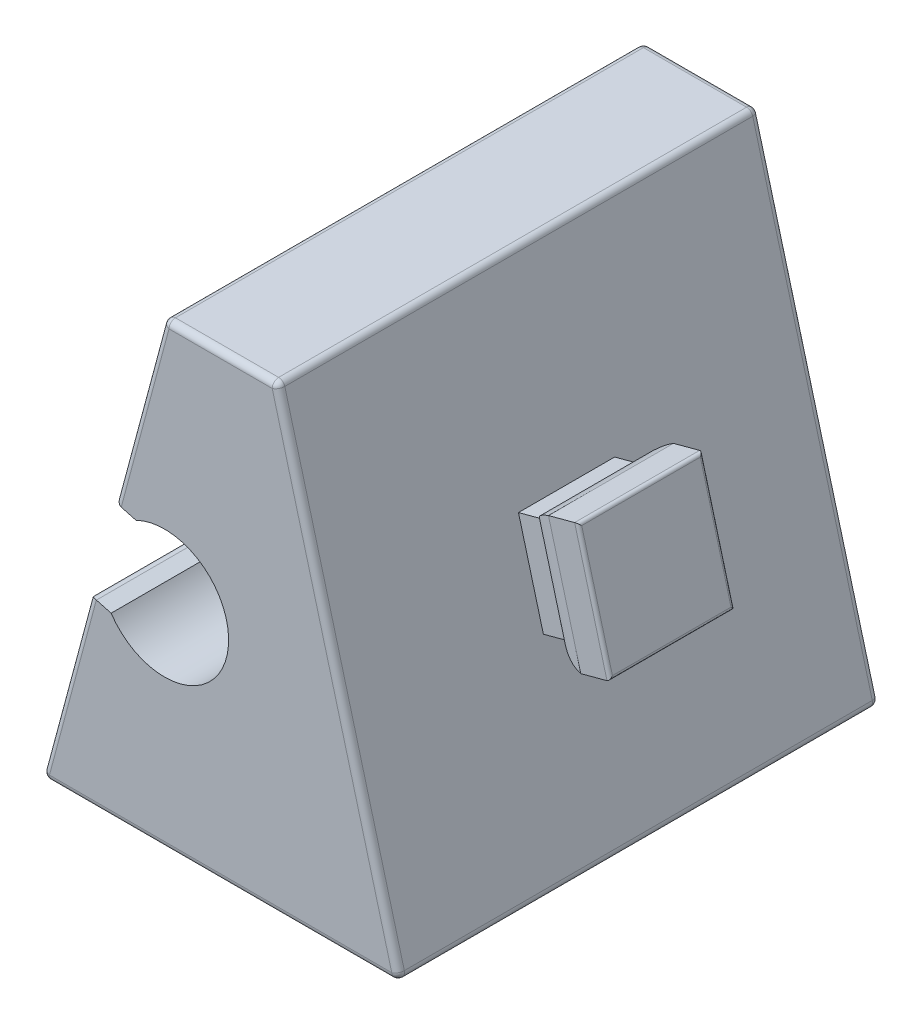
ISO-10303-21;
HEADER;
FILE_DESCRIPTION(('STEP AP214'),'2;1');
FILE_NAME('part.step','',(''),(''),'','','');
FILE_SCHEMA(('AUTOMOTIVE_DESIGN { 1 0 10303 214 1 1 1 1 }'));
ENDSEC;
DATA;
#1=APPLICATION_CONTEXT('core data for automotive mechanical design processes');
#2=APPLICATION_PROTOCOL_DEFINITION('international standard','automotive_design',2000,#1);
#3=PRODUCT_CONTEXT('',#1,'mechanical');
#4=PRODUCT('Part','Part','',(#3));
#5=PRODUCT_RELATED_PRODUCT_CATEGORY('part','',(#4));
#6=PRODUCT_DEFINITION_FORMATION('','',#4);
#7=PRODUCT_DEFINITION_CONTEXT('part definition',#1,'design');
#8=PRODUCT_DEFINITION('design','',#6,#7);
#9=PRODUCT_DEFINITION_SHAPE('','',#8);
#10=(LENGTH_UNIT() NAMED_UNIT(*) SI_UNIT(.MILLI.,.METRE.));
#11=(NAMED_UNIT(*) PLANE_ANGLE_UNIT() SI_UNIT($,.RADIAN.));
#12=(NAMED_UNIT(*) SI_UNIT($,.STERADIAN.) SOLID_ANGLE_UNIT());
#13=UNCERTAINTY_MEASURE_WITH_UNIT(LENGTH_MEASURE(1.E-05),#10,'distance_accuracy_value','');
#14=(GEOMETRIC_REPRESENTATION_CONTEXT(3) GLOBAL_UNCERTAINTY_ASSIGNED_CONTEXT((#13)) GLOBAL_UNIT_ASSIGNED_CONTEXT((#10,
#11,#12)) REPRESENTATION_CONTEXT('',''));
#15=CARTESIAN_POINT('',(0.,0.,0.));
#16=DIRECTION('',(0.,0.,1.));
#17=DIRECTION('',(1.,0.,0.));
#18=AXIS2_PLACEMENT_3D('',#15,#16,#17);
#19=CARTESIAN_POINT('',(5.19043169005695,11.1877880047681,5.55));
#20=DIRECTION('',(0.965925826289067,0.258819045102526,0.));
#21=DIRECTION('',(-0.258819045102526,0.965925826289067,0.));
#22=AXIS2_PLACEMENT_3D('',#19,#20,#21);
#23=PLANE('',#22);
#24=DIRECTION('',(0.258819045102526,-0.965925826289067,0.));
#25=VECTOR('',#24,1.);
#26=CARTESIAN_POINT('',(5.19043169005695,11.1877880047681,9.35));
#27=LINE('',#26,#25);
#28=CARTESIAN_POINT('',(5.61748311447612,9.59401039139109,9.35));
#29=VERTEX_POINT('',#28);
#30=CARTESIAN_POINT('',(6.57511358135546,6.02008483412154,9.35));
#31=VERTEX_POINT('',#30);
#32=EDGE_CURVE('E362',#29,#31,#27,.T.);
#33=ORIENTED_EDGE('',*,*,#32,.T.);
#34=DIRECTION('',(0.,0.,-1.));
#35=VECTOR('',#34,1.);
#36=CARTESIAN_POINT('',(6.57511358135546,6.02008483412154,5.55));
#37=LINE('',#36,#35);
#38=CARTESIAN_POINT('',(6.57511358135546,6.02008483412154,5.65));
#39=VERTEX_POINT('',#38);
#40=EDGE_CURVE('E448',#31,#39,#37,.T.);
#41=ORIENTED_EDGE('',*,*,#40,.T.);
#42=DIRECTION('',(0.258819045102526,-0.965925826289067,0.));
#43=VECTOR('',#42,1.);
#44=CARTESIAN_POINT('',(5.19043169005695,11.1877880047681,5.65));
#45=LINE('',#44,#43);
#46=CARTESIAN_POINT('',(5.61748311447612,9.59401039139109,5.65));
#47=VERTEX_POINT('',#46);
#48=EDGE_CURVE('E446',#39,#47,#45,.F.);
#49=ORIENTED_EDGE('',*,*,#48,.T.);
#50=DIRECTION('',(0.,0.,-1.));
#51=VECTOR('',#50,1.);
#52=CARTESIAN_POINT('',(5.61748311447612,9.59401039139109,5.55));
#53=LINE('',#52,#51);
#54=EDGE_CURVE('E444',#47,#29,#53,.F.);
#55=ORIENTED_EDGE('',*,*,#54,.T.);
#56=EDGE_LOOP('',(#33,#41,#49,#55));
#57=FACE_BOUND('',#56,.T.);
#58=ADVANCED_FACE('F34',(#57),#23,.T.);
#59=CARTESIAN_POINT('',(5.19043169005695,11.1877880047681,5.55));
#60=DIRECTION('',(0.,0.,-1.));
#61=DIRECTION('',(-1.,0.,0.));
#62=AXIS2_PLACEMENT_3D('',#59,#60,#61);
#63=PLANE('',#62);
#64=DIRECTION('',(0.965925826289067,0.258819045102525,0.));
#65=VECTOR('',#64,1.);
#66=CARTESIAN_POINT('',(5.59160120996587,9.69060297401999,5.55));
#67=LINE('',#66,#65);
#68=CARTESIAN_POINT('',(4.67937146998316,9.44617175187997,5.55));
#69=VERTEX_POINT('',#68);
#70=CARTESIAN_POINT('',(5.49500862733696,9.66472106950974,5.55));
#71=VERTEX_POINT('',#70);
#72=EDGE_CURVE('E479',#69,#71,#67,.T.);
#73=ORIENTED_EDGE('',*,*,#72,.T.);
#74=DIRECTION('',(0.258819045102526,-0.965925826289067,0.));
#75=VECTOR('',#74,1.);
#76=CARTESIAN_POINT('',(5.09383910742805,11.1619061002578,5.55));
#77=LINE('',#76,#75);
#78=CARTESIAN_POINT('',(6.50440290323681,5.89761034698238,5.55));
#79=VERTEX_POINT('',#78);
#80=EDGE_CURVE('E454',#71,#79,#77,.T.);
#81=ORIENTED_EDGE('',*,*,#80,.T.);
#82=DIRECTION('',(-0.965925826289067,-0.258819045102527,0.));
#83=VECTOR('',#82,1.);
#84=CARTESIAN_POINT('',(6.60099548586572,5.92349225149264,5.55));
#85=LINE('',#84,#83);
#86=CARTESIAN_POINT('',(5.68876574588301,5.67906102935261,5.55));
#87=VERTEX_POINT('',#86);
#88=EDGE_CURVE('E244',#79,#87,#85,.T.);
#89=ORIENTED_EDGE('',*,*,#88,.T.);
#90=DIRECTION('',(0.258819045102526,-0.965925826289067,0.));
#91=VECTOR('',#90,1.);
#92=CARTESIAN_POINT('',(4.27820195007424,10.943356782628,5.55));
#93=LINE('',#92,#91);
#94=EDGE_CURVE('E243',#69,#87,#93,.T.);
#95=ORIENTED_EDGE('',*,*,#94,.F.);
#96=EDGE_LOOP('',(#73,#81,#89,#95));
#97=FACE_BOUND('',#96,.T.);
#98=ADVANCED_FACE('F478',(#97),#63,.T.);
#99=CARTESIAN_POINT('',(4.70746877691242,11.0583784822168,7.5));
#100=DIRECTION('',(0.258819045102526,-0.965925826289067,0.));
#101=DIRECTION('',(0.965925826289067,0.258819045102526,0.));
#102=AXIS2_PLACEMENT_3D('',#99,#100,#101);
#103=CYLINDRICAL_SURFACE('',#102,2.);
#104=ORIENTED_EDGE('',*,*,#94,.T.);
#105=CARTESIAN_POINT('',(5.61333543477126,7.67763809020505,7.5));
#106=DIRECTION('',(0.183012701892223,-0.683012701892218,0.707106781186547));
#107=DIRECTION('',(0.183012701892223,-0.683012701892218,-0.707106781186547));
#108=AXIS2_PLACEMENT_3D('',#105,#106,#107);
#109=ELLIPSE('',#108,2.82842712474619,2.);
#110=CARTESIAN_POINT('',(4.72376424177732,5.8863639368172,6.));
#111=VERTEX_POINT('',#110);
#112=EDGE_CURVE('E223',#87,#111,#109,.F.);
#113=ORIENTED_EDGE('',*,*,#112,.T.);
#114=DIRECTION('',(0.258819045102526,-0.965925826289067,0.));
#115=VECTOR('',#114,1.);
#116=CARTESIAN_POINT('',(3.42966901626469,10.7159930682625,6.));
#117=LINE('',#116,#115);
#118=CARTESIAN_POINT('',(3.94730710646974,8.78414141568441,6.));
#119=VERTEX_POINT('',#118);
#120=EDGE_CURVE('E240',#119,#111,#117,.T.);
#121=ORIENTED_EDGE('',*,*,#120,.F.);
#122=CARTESIAN_POINT('',(5.61333543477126,7.67763809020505,7.5));
#123=DIRECTION('',(0.183012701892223,-0.683012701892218,-0.707106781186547));
#124=DIRECTION('',(0.183012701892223,-0.683012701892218,0.707106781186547));
#125=AXIS2_PLACEMENT_3D('',#122,#123,#124);
#126=ELLIPSE('',#125,2.82842712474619,2.);
#127=EDGE_CURVE('E981',#119,#69,#126,.T.);
#128=ORIENTED_EDGE('',*,*,#127,.T.);
#129=EDGE_LOOP('',(#104,#113,#121,#128));
#130=FACE_BOUND('',#129,.T.);
#131=ADVANCED_FACE('F238',(#130),#103,.T.);
#132=CARTESIAN_POINT('',(4.70746877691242,11.0583784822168,7.5));
#133=DIRECTION('',(0.258819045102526,-0.965925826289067,0.));
#134=DIRECTION('',(0.965925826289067,0.258819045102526,0.));
#135=AXIS2_PLACEMENT_3D('',#132,#133,#134);
#136=CYLINDRICAL_SURFACE('',#135,2.);
#137=DIRECTION('',(0.258819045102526,-0.965925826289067,0.));
#138=VECTOR('',#137,1.);
#139=CARTESIAN_POINT('',(3.42966901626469,10.7159930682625,9.));
#140=LINE('',#139,#138);
#141=CARTESIAN_POINT('',(3.94730710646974,8.78414141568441,9.));
#142=VERTEX_POINT('',#141);
#143=CARTESIAN_POINT('',(4.72376424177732,5.8863639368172,9.));
#144=VERTEX_POINT('',#143);
#145=EDGE_CURVE('E253',#142,#144,#140,.T.);
#146=ORIENTED_EDGE('',*,*,#145,.T.);
#147=CARTESIAN_POINT('',(5.61333543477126,7.67763809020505,7.5));
#148=DIRECTION('',(0.183012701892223,-0.683012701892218,-0.707106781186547));
#149=DIRECTION('',(0.183012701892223,-0.683012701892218,0.707106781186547));
#150=AXIS2_PLACEMENT_3D('',#147,#148,#149);
#151=ELLIPSE('',#150,2.82842712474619,2.);
#152=CARTESIAN_POINT('',(5.68876574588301,5.67906102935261,9.45));
#153=VERTEX_POINT('',#152);
#154=EDGE_CURVE('E226',#144,#153,#151,.F.);
#155=ORIENTED_EDGE('',*,*,#154,.T.);
#156=DIRECTION('',(0.258819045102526,-0.965925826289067,0.));
#157=VECTOR('',#156,1.);
#158=CARTESIAN_POINT('',(4.27820195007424,10.943356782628,9.45));
#159=LINE('',#158,#157);
#160=CARTESIAN_POINT('',(4.67937146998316,9.44617175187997,9.45));
#161=VERTEX_POINT('',#160);
#162=EDGE_CURVE('E979',#161,#153,#159,.T.);
#163=ORIENTED_EDGE('',*,*,#162,.F.);
#164=CARTESIAN_POINT('',(5.61333543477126,7.67763809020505,7.5));
#165=DIRECTION('',(0.183012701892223,-0.683012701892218,0.707106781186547));
#166=DIRECTION('',(0.183012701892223,-0.683012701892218,-0.707106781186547));
#167=AXIS2_PLACEMENT_3D('',#164,#165,#166);
#168=ELLIPSE('',#167,2.82842712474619,2.);
#169=EDGE_CURVE('E977',#161,#142,#168,.T.);
#170=ORIENTED_EDGE('',*,*,#169,.T.);
#171=EDGE_LOOP('',(#146,#155,#163,#170));
#172=FACE_BOUND('',#171,.T.);
#173=ADVANCED_FACE('F842',(#172),#136,.T.);
#174=CARTESIAN_POINT('',(5.19043169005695,11.1877880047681,9.45));
#175=DIRECTION('',(0.,0.,1.));
#176=DIRECTION('',(1.,0.,0.));
#177=AXIS2_PLACEMENT_3D('',#174,#175,#176);
#178=PLANE('',#177);
#179=DIRECTION('',(0.965925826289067,0.258819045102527,0.));
#180=VECTOR('',#179,1.);
#181=CARTESIAN_POINT('',(6.60099548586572,5.92349225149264,9.45));
#182=LINE('',#181,#180);
#183=CARTESIAN_POINT('',(6.50440290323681,5.89761034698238,9.45));
#184=VERTEX_POINT('',#183);
#185=EDGE_CURVE('E290',#153,#184,#182,.T.);
#186=ORIENTED_EDGE('',*,*,#185,.T.);
#187=DIRECTION('',(0.258819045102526,-0.965925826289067,0.));
#188=VECTOR('',#187,1.);
#189=CARTESIAN_POINT('',(5.09383910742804,11.1619061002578,9.45));
#190=LINE('',#189,#188);
#191=CARTESIAN_POINT('',(5.49500862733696,9.66472106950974,9.45));
#192=VERTEX_POINT('',#191);
#193=EDGE_CURVE('E11',#184,#192,#190,.F.);
#194=ORIENTED_EDGE('',*,*,#193,.T.);
#195=DIRECTION('',(-0.965925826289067,-0.258819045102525,0.));
#196=VECTOR('',#195,1.);
#197=CARTESIAN_POINT('',(5.59160120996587,9.69060297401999,9.45));
#198=LINE('',#197,#196);
#199=EDGE_CURVE('E231',#192,#161,#198,.T.);
#200=ORIENTED_EDGE('',*,*,#199,.T.);
#201=ORIENTED_EDGE('',*,*,#162,.T.);
#202=EDGE_LOOP('',(#186,#194,#200,#201));
#203=FACE_BOUND('',#202,.T.);
#204=ADVANCED_FACE('F497',(#203),#178,.T.);
#205=CARTESIAN_POINT('',(5.6,0.,15.));
#206=DIRECTION('',(-0.965925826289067,-0.258819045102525,0.));
#207=DIRECTION('',(0.258819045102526,-0.965925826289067,0.));
#208=AXIS2_PLACEMENT_3D('',#205,#206,#207);
#209=PLANE('',#208);
#210=DIRECTION('',(-0.258819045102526,0.965925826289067,0.));
#211=VECTOR('',#210,1.);
#212=CARTESIAN_POINT('',(5.6,0.,14.8));
#213=LINE('',#212,#211);
#214=CARTESIAN_POINT('',(1.80268733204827,14.1717638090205,14.8));
#215=VERTEX_POINT('',#214);
#216=CARTESIAN_POINT('',(5.53254009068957,0.251763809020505,14.8));
#217=VERTEX_POINT('',#216);
#218=EDGE_CURVE('E338',#215,#217,#213,.F.);
#219=ORIENTED_EDGE('',*,*,#218,.T.);
#220=DIRECTION('',(0.,0.,-1.));
#221=VECTOR('',#220,1.);
#222=CARTESIAN_POINT('',(5.53254009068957,0.251763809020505,15.));
#223=LINE('',#222,#221);
#224=CARTESIAN_POINT('',(5.53254009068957,0.251763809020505,0.200000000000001));
#225=VERTEX_POINT('',#224);
#226=EDGE_CURVE('E340',#217,#225,#223,.T.);
#227=ORIENTED_EDGE('',*,*,#226,.T.);
#228=DIRECTION('',(-0.258819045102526,0.965925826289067,0.));
#229=VECTOR('',#228,1.);
#230=CARTESIAN_POINT('',(5.6,0.,0.200000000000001));
#231=LINE('',#230,#229);
#232=CARTESIAN_POINT('',(1.80268733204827,14.1717638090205,0.200000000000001));
#233=VERTEX_POINT('',#232);
#234=EDGE_CURVE('E336',#225,#233,#231,.T.);
#235=ORIENTED_EDGE('',*,*,#234,.T.);
#236=DIRECTION('',(0.,0.,-1.));
#237=VECTOR('',#236,1.);
#238=CARTESIAN_POINT('',(1.80268733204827,14.1717638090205,15.));
#239=LINE('',#238,#237);
#240=EDGE_CURVE('E334',#233,#215,#239,.F.);
#241=ORIENTED_EDGE('',*,*,#240,.T.);
#242=EDGE_LOOP('',(#219,#227,#235,#241));
#243=FACE_BOUND('',#242,.T.);
#244=DIRECTION('',(-0.258819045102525,0.965925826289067,0.));
#245=VECTOR('',#244,1.);
#246=CARTESIAN_POINT('',(3.29325521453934,8.6088887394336,6.));
#247=LINE('',#246,#245);
#248=CARTESIAN_POINT('',(4.06971234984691,5.7111112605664,6.));
#249=VERTEX_POINT('',#248);
#250=CARTESIAN_POINT('',(3.29325521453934,8.6088887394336,6.));
#251=VERTEX_POINT('',#250);
#252=EDGE_CURVE('E987',#249,#251,#247,.T.);
#253=ORIENTED_EDGE('',*,*,#252,.F.);
#254=DIRECTION('',(0.,0.,-1.));
#255=VECTOR('',#254,1.);
#256=CARTESIAN_POINT('',(4.06971234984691,5.7111112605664,9.));
#257=LINE('',#256,#255);
#258=CARTESIAN_POINT('',(4.06971234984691,5.7111112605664,9.));
#259=VERTEX_POINT('',#258);
#260=EDGE_CURVE('E258',#259,#249,#257,.T.);
#261=ORIENTED_EDGE('',*,*,#260,.F.);
#262=DIRECTION('',(0.258819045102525,-0.965925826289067,0.));
#263=VECTOR('',#262,1.);
#264=CARTESIAN_POINT('',(3.29325521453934,8.6088887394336,9.));
#265=LINE('',#264,#263);
#266=CARTESIAN_POINT('',(3.29325521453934,8.60888873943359,9.));
#267=VERTEX_POINT('',#266);
#268=EDGE_CURVE('E263',#267,#259,#265,.T.);
#269=ORIENTED_EDGE('',*,*,#268,.F.);
#270=DIRECTION('',(0.,0.,1.));
#271=VECTOR('',#270,1.);
#272=CARTESIAN_POINT('',(3.29325521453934,8.6088887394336,9.));
#273=LINE('',#272,#271);
#274=EDGE_CURVE('E989',#251,#267,#273,.T.);
#275=ORIENTED_EDGE('',*,*,#274,.F.);
#276=EDGE_LOOP('',(#253,#261,#269,#275));
#277=FACE_BOUND('',#276,.T.);
#278=ADVANCED_FACE('F533',(#243,#277),#209,.F.);
#279=CARTESIAN_POINT('',(-5.6,0.,15.));
#280=DIRECTION('',(0.965925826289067,-0.258819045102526,0.));
#281=DIRECTION('',(0.258819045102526,0.965925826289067,0.));
#282=AXIS2_PLACEMENT_3D('',#279,#280,#281);
#283=PLANE('',#282);
#284=DIRECTION('',(0.,0.,-1.));
#285=VECTOR('',#284,1.);
#286=CARTESIAN_POINT('',(-1.80268733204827,14.1717638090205,15.));
#287=LINE('',#286,#285);
#288=CARTESIAN_POINT('',(-1.80268733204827,14.1717638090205,14.8));
#289=VERTEX_POINT('',#288);
#290=CARTESIAN_POINT('',(-1.80268733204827,14.1717638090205,0.200000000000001));
#291=VERTEX_POINT('',#290);
#292=EDGE_CURVE('E292',#289,#291,#287,.T.);
#293=ORIENTED_EDGE('',*,*,#292,.T.);
#294=DIRECTION('',(-0.258819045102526,-0.965925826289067,0.));
#295=VECTOR('',#294,1.);
#296=CARTESIAN_POINT('',(-5.6,0.,0.200000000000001));
#297=LINE('',#296,#295);
#298=CARTESIAN_POINT('',(-3.24149140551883,8.80207390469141,0.200000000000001));
#299=VERTEX_POINT('',#298);
#300=EDGE_CURVE('E298',#291,#299,#297,.T.);
#301=ORIENTED_EDGE('',*,*,#300,.T.);
#302=DIRECTION('',(0.,0.,1.));
#303=VECTOR('',#302,1.);
#304=CARTESIAN_POINT('',(-3.24149140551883,8.80207390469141,15.));
#305=LINE('',#304,#303);
#306=CARTESIAN_POINT('',(-3.24149140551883,8.80207390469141,14.8));
#307=VERTEX_POINT('',#306);
#308=EDGE_CURVE('E296',#299,#307,#305,.T.);
#309=ORIENTED_EDGE('',*,*,#308,.T.);
#310=DIRECTION('',(-0.258819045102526,-0.965925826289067,0.));
#311=VECTOR('',#310,1.);
#312=CARTESIAN_POINT('',(-1.76296756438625,14.32,14.8));
#313=LINE('',#312,#311);
#314=EDGE_CURVE('E294',#307,#289,#313,.F.);
#315=ORIENTED_EDGE('',*,*,#314,.T.);
#316=EDGE_LOOP('',(#293,#301,#309,#315));
#317=FACE_BOUND('',#316,.T.);
#318=ADVANCED_FACE('F536',(#317),#283,.F.);
#319=CARTESIAN_POINT('',(-1.76296756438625,14.32,15.));
#320=DIRECTION('',(0.,-1.,0.));
#321=DIRECTION('',(1.,0.,0.));
#322=AXIS2_PLACEMENT_3D('',#319,#320,#321);
#323=PLANE('',#322);
#324=DIRECTION('',(0.,0.,-1.));
#325=VECTOR('',#324,1.);
#326=CARTESIAN_POINT('',(1.60950216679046,14.32,15.));
#327=LINE('',#326,#325);
#328=CARTESIAN_POINT('',(1.60950216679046,14.32,14.8));
#329=VERTEX_POINT('',#328);
#330=CARTESIAN_POINT('',(1.60950216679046,14.32,0.200000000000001));
#331=VERTEX_POINT('',#330);
#332=EDGE_CURVE('E355',#329,#331,#327,.T.);
#333=ORIENTED_EDGE('',*,*,#332,.T.);
#334=DIRECTION('',(-1.,0.,0.));
#335=VECTOR('',#334,1.);
#336=CARTESIAN_POINT('',(-1.76296756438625,14.32,0.200000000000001));
#337=LINE('',#336,#335);
#338=CARTESIAN_POINT('',(-1.60950216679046,14.32,0.200000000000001));
#339=VERTEX_POINT('',#338);
#340=EDGE_CURVE('E359',#331,#339,#337,.T.);
#341=ORIENTED_EDGE('',*,*,#340,.T.);
#342=DIRECTION('',(0.,0.,-1.));
#343=VECTOR('',#342,1.);
#344=CARTESIAN_POINT('',(-1.60950216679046,14.32,15.));
#345=LINE('',#344,#343);
#346=CARTESIAN_POINT('',(-1.60950216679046,14.32,14.8));
#347=VERTEX_POINT('',#346);
#348=EDGE_CURVE('E357',#339,#347,#345,.F.);
#349=ORIENTED_EDGE('',*,*,#348,.T.);
#350=DIRECTION('',(-1.,0.,0.));
#351=VECTOR('',#350,1.);
#352=CARTESIAN_POINT('',(1.76296756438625,14.32,14.8));
#353=LINE('',#352,#351);
#354=EDGE_CURVE('E353',#347,#329,#353,.F.);
#355=ORIENTED_EDGE('',*,*,#354,.T.);
#356=EDGE_LOOP('',(#333,#341,#349,#355));
#357=FACE_BOUND('',#356,.T.);
#358=ADVANCED_FACE('F544',(#357),#323,.F.);
#359=DIRECTION('',(0.,0.,1.));
#360=VECTOR('',#359,1.);
#361=CARTESIAN_POINT('',(-4.12147615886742,5.51792609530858,15.));
#362=LINE('',#361,#360);
#363=CARTESIAN_POINT('',(-4.12147615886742,5.51792609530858,14.8));
#364=VERTEX_POINT('',#363);
#365=CARTESIAN_POINT('',(-4.12147615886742,5.51792609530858,0.200000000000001));
#366=VERTEX_POINT('',#365);
#367=EDGE_CURVE('E314',#364,#366,#362,.F.);
#368=ORIENTED_EDGE('',*,*,#367,.T.);
#369=DIRECTION('',(-0.258819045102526,-0.965925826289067,0.));
#370=VECTOR('',#369,1.);
#371=CARTESIAN_POINT('',(-5.6,0.,0.200000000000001));
#372=LINE('',#371,#370);
#373=CARTESIAN_POINT('',(-5.53254009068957,0.251763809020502,0.200000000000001));
#374=VERTEX_POINT('',#373);
#375=EDGE_CURVE('E318',#366,#374,#372,.T.);
#376=ORIENTED_EDGE('',*,*,#375,.T.);
#377=DIRECTION('',(0.,0.,-1.));
#378=VECTOR('',#377,1.);
#379=CARTESIAN_POINT('',(-5.53254009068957,0.251763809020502,15.));
#380=LINE('',#379,#378);
#381=CARTESIAN_POINT('',(-5.53254009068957,0.251763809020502,14.8));
#382=VERTEX_POINT('',#381);
#383=EDGE_CURVE('E316',#374,#382,#380,.F.);
#384=ORIENTED_EDGE('',*,*,#383,.T.);
#385=DIRECTION('',(-0.258819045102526,-0.965925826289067,0.));
#386=VECTOR('',#385,1.);
#387=CARTESIAN_POINT('',(-4.06971234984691,5.71111126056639,14.8));
#388=LINE('',#387,#386);
#389=EDGE_CURVE('E312',#382,#364,#388,.F.);
#390=ORIENTED_EDGE('',*,*,#389,.T.);
#391=EDGE_LOOP('',(#368,#376,#384,#390));
#392=FACE_BOUND('',#391,.T.);
#393=ADVANCED_FACE('F540',(#392),#283,.F.);
#394=CARTESIAN_POINT('',(-5.6,0.,15.));
#395=DIRECTION('',(0.,1.,0.));
#396=DIRECTION('',(-1.,0.,0.));
#397=AXIS2_PLACEMENT_3D('',#394,#395,#396);
#398=PLANE('',#397);
#399=DIRECTION('',(0.,0.,-1.));
#400=VECTOR('',#399,1.);
#401=CARTESIAN_POINT('',(-5.33935492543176,0.,15.));
#402=LINE('',#401,#400);
#403=CARTESIAN_POINT('',(-5.33935492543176,0.,14.8));
#404=VERTEX_POINT('',#403);
#405=CARTESIAN_POINT('',(-5.33935492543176,0.,0.200000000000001));
#406=VERTEX_POINT('',#405);
#407=EDGE_CURVE('E325',#404,#406,#402,.T.);
#408=ORIENTED_EDGE('',*,*,#407,.T.);
#409=DIRECTION('',(1.,0.,0.));
#410=VECTOR('',#409,1.);
#411=CARTESIAN_POINT('',(-5.6,0.,0.200000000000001));
#412=LINE('',#411,#410);
#413=CARTESIAN_POINT('',(5.33935492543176,0.,0.200000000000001));
#414=VERTEX_POINT('',#413);
#415=EDGE_CURVE('E327',#406,#414,#412,.T.);
#416=ORIENTED_EDGE('',*,*,#415,.T.);
#417=DIRECTION('',(0.,0.,-1.));
#418=VECTOR('',#417,1.);
#419=CARTESIAN_POINT('',(5.33935492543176,0.,15.));
#420=LINE('',#419,#418);
#421=CARTESIAN_POINT('',(5.33935492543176,0.,14.8));
#422=VERTEX_POINT('',#421);
#423=EDGE_CURVE('E323',#414,#422,#420,.F.);
#424=ORIENTED_EDGE('',*,*,#423,.T.);
#425=DIRECTION('',(1.,0.,0.));
#426=VECTOR('',#425,1.);
#427=CARTESIAN_POINT('',(-5.6,0.,14.8));
#428=LINE('',#427,#426);
#429=EDGE_CURVE('E321',#422,#404,#428,.F.);
#430=ORIENTED_EDGE('',*,*,#429,.T.);
#431=EDGE_LOOP('',(#408,#416,#424,#430));
#432=FACE_BOUND('',#431,.T.);
#433=ADVANCED_FACE('F528',(#432),#398,.F.);
#434=CARTESIAN_POINT('',(0.,0.,15.));
#435=DIRECTION('',(0.,0.,1.));
#436=DIRECTION('',(1.,0.,0.));
#437=AXIS2_PLACEMENT_3D('',#434,#435,#436);
#438=PLANE('',#437);
#439=DIRECTION('',(0.965925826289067,-0.258819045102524,0.));
#440=VECTOR('',#439,1.);
#441=CARTESIAN_POINT('',(-4.06971234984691,5.71111126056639,15.));
#442=LINE('',#441,#440);
#443=CARTESIAN_POINT('',(-3.8765271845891,5.65934745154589,15.));
#444=VERTEX_POINT('',#443);
#445=CARTESIAN_POINT('',(-3.4156604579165,5.53585858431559,15.));
#446=VERTEX_POINT('',#445);
#447=EDGE_CURVE('E269',#444,#446,#442,.T.);
#448=ORIENTED_EDGE('',*,*,#447,.F.);
#449=DIRECTION('',(-0.258819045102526,-0.965925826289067,0.));
#450=VECTOR('',#449,1.);
#451=CARTESIAN_POINT('',(-5.40681483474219,-0.051763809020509,15.));
#452=LINE('',#451,#450);
#453=CARTESIAN_POINT('',(-5.33935492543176,0.199999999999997,15.));
#454=VERTEX_POINT('',#453);
#455=EDGE_CURVE('E351',#444,#454,#452,.T.);
#456=ORIENTED_EDGE('',*,*,#455,.T.);
#457=DIRECTION('',(1.,0.,0.));
#458=VECTOR('',#457,1.);
#459=CARTESIAN_POINT('',(5.6,0.2,15.));
#460=LINE('',#459,#458);
#461=CARTESIAN_POINT('',(5.33935492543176,0.2,15.));
#462=VERTEX_POINT('',#461);
#463=EDGE_CURVE('E349',#454,#462,#460,.T.);
#464=ORIENTED_EDGE('',*,*,#463,.T.);
#465=DIRECTION('',(-0.258819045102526,0.965925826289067,0.));
#466=VECTOR('',#465,1.);
#467=CARTESIAN_POINT('',(1.56978239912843,14.2682361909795,15.));
#468=LINE('',#467,#466);
#469=CARTESIAN_POINT('',(1.60950216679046,14.12,15.));
#470=VERTEX_POINT('',#469);
#471=EDGE_CURVE('E345',#462,#470,#468,.T.);
#472=ORIENTED_EDGE('',*,*,#471,.T.);
#473=DIRECTION('',(-1.,0.,0.));
#474=VECTOR('',#473,1.);
#475=CARTESIAN_POINT('',(-1.76296756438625,14.12,15.));
#476=LINE('',#475,#474);
#477=CARTESIAN_POINT('',(-1.60950216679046,14.12,15.));
#478=VERTEX_POINT('',#477);
#479=EDGE_CURVE('E343',#470,#478,#476,.T.);
#480=ORIENTED_EDGE('',*,*,#479,.T.);
#481=DIRECTION('',(-0.258819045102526,-0.965925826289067,0.));
#482=VECTOR('',#481,1.);
#483=CARTESIAN_POINT('',(-3.10007004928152,8.55712493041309,15.));
#484=LINE('',#483,#482);
#485=CARTESIAN_POINT('',(-3.10007004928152,8.55712493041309,15.));
#486=VERTEX_POINT('',#485);
#487=EDGE_CURVE('E347',#478,#486,#484,.T.);
#488=ORIENTED_EDGE('',*,*,#487,.T.);
#489=DIRECTION('',(-0.965925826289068,0.258819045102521,0.));
#490=VECTOR('',#489,1.);
#491=CARTESIAN_POINT('',(-3.29325521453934,8.60888873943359,15.));
#492=LINE('',#491,#490);
#493=CARTESIAN_POINT('',(-2.63920332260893,8.43363606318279,15.));
#494=VERTEX_POINT('',#493);
#495=EDGE_CURVE('E273',#494,#486,#492,.T.);
#496=ORIENTED_EDGE('',*,*,#495,.F.);
#497=CARTESIAN_POINT('',(-1.74963212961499,6.64236190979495,15.));
#498=DIRECTION('',(0.,0.,1.));
#499=DIRECTION('',(1.,0.,0.));
#500=AXIS2_PLACEMENT_3D('',#497,#498,#499);
#501=CIRCLE('',#500,2.);
#502=EDGE_CURVE('E281',#446,#494,#501,.T.);
#503=ORIENTED_EDGE('',*,*,#502,.F.);
#504=EDGE_LOOP('',(#448,#456,#464,#472,#480,#488,#496,#503));
#505=FACE_BOUND('',#504,.T.);
#506=ADVANCED_FACE('F525',(#505),#438,.T.);
#507=CARTESIAN_POINT('',(0.,0.,0.));
#508=DIRECTION('',(0.,0.,1.));
#509=DIRECTION('',(1.,0.,0.));
#510=AXIS2_PLACEMENT_3D('',#507,#508,#509);
#511=PLANE('',#510);
#512=DIRECTION('',(-0.965925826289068,0.258819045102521,0.));
#513=VECTOR('',#512,1.);
#514=CARTESIAN_POINT('',(-3.29325521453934,8.60888873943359,0.));
#515=LINE('',#514,#513);
#516=CARTESIAN_POINT('',(-2.63920332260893,8.43363606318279,0.));
#517=VERTEX_POINT('',#516);
#518=CARTESIAN_POINT('',(-3.10007004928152,8.55712493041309,0.));
#519=VERTEX_POINT('',#518);
#520=EDGE_CURVE('E276',#517,#519,#515,.T.);
#521=ORIENTED_EDGE('',*,*,#520,.T.);
#522=DIRECTION('',(-0.258819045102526,-0.965925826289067,0.));
#523=VECTOR('',#522,1.);
#524=CARTESIAN_POINT('',(-5.0316859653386,1.34823619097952,0.));
#525=LINE('',#524,#523);
#526=CARTESIAN_POINT('',(-1.60950216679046,14.12,0.));
#527=VERTEX_POINT('',#526);
#528=EDGE_CURVE('E309',#519,#527,#525,.F.);
#529=ORIENTED_EDGE('',*,*,#528,.T.);
#530=DIRECTION('',(-1.,0.,0.));
#531=VECTOR('',#530,1.);
#532=CARTESIAN_POINT('',(0.,14.12,0.));
#533=LINE('',#532,#531);
#534=CARTESIAN_POINT('',(1.60950216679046,14.12,0.));
#535=VERTEX_POINT('',#534);
#536=EDGE_CURVE('E301',#527,#535,#533,.F.);
#537=ORIENTED_EDGE('',*,*,#536,.T.);
#538=DIRECTION('',(-0.258819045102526,0.965925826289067,0.));
#539=VECTOR('',#538,1.);
#540=CARTESIAN_POINT('',(5.0316859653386,1.34823619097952,0.));
#541=LINE('',#540,#539);
#542=CARTESIAN_POINT('',(5.33935492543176,0.2,0.));
#543=VERTEX_POINT('',#542);
#544=EDGE_CURVE('E303',#535,#543,#541,.F.);
#545=ORIENTED_EDGE('',*,*,#544,.T.);
#546=DIRECTION('',(1.,0.,0.));
#547=VECTOR('',#546,1.);
#548=CARTESIAN_POINT('',(0.,0.199999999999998,0.));
#549=LINE('',#548,#547);
#550=CARTESIAN_POINT('',(-5.33935492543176,0.199999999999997,0.));
#551=VERTEX_POINT('',#550);
#552=EDGE_CURVE('E305',#543,#551,#549,.F.);
#553=ORIENTED_EDGE('',*,*,#552,.T.);
#554=DIRECTION('',(-0.258819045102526,-0.965925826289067,0.));
#555=VECTOR('',#554,1.);
#556=CARTESIAN_POINT('',(-5.0316859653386,1.34823619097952,0.));
#557=LINE('',#556,#555);
#558=CARTESIAN_POINT('',(-3.8765271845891,5.65934745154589,0.));
#559=VERTEX_POINT('',#558);
#560=EDGE_CURVE('E307',#551,#559,#557,.F.);
#561=ORIENTED_EDGE('',*,*,#560,.T.);
#562=DIRECTION('',(0.965925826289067,-0.258819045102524,0.));
#563=VECTOR('',#562,1.);
#564=CARTESIAN_POINT('',(-4.06971234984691,5.71111126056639,0.));
#565=LINE('',#564,#563);
#566=CARTESIAN_POINT('',(-3.4156604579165,5.53585858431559,0.));
#567=VERTEX_POINT('',#566);
#568=EDGE_CURVE('E270',#559,#567,#565,.T.);
#569=ORIENTED_EDGE('',*,*,#568,.T.);
#570=CARTESIAN_POINT('',(-1.74963212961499,6.64236190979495,0.));
#571=DIRECTION('',(0.,0.,1.));
#572=DIRECTION('',(1.,0.,0.));
#573=AXIS2_PLACEMENT_3D('',#570,#571,#572);
#574=CIRCLE('',#573,2.);
#575=EDGE_CURVE('E272',#567,#517,#574,.T.);
#576=ORIENTED_EDGE('',*,*,#575,.T.);
#577=EDGE_LOOP('',(#521,#529,#537,#545,#553,#561,#569,#576));
#578=FACE_BOUND('',#577,.T.);
#579=ADVANCED_FACE('F517',(#578),#511,.F.);
#580=CARTESIAN_POINT('',(-3.29325521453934,8.60888873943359,0.));
#581=DIRECTION('',(0.258819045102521,0.965925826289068,0.));
#582=DIRECTION('',(-0.965925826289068,0.258819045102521,0.));
#583=AXIS2_PLACEMENT_3D('',#580,#581,#582);
#584=PLANE('',#583);
#585=ORIENTED_EDGE('',*,*,#495,.T.);
#586=DIRECTION('',(0.,0.,1.));
#587=VECTOR('',#586,1.);
#588=CARTESIAN_POINT('',(-3.10007004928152,8.55712493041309,0.));
#589=LINE('',#588,#587);
#590=EDGE_CURVE('E332',#486,#519,#589,.F.);
#591=ORIENTED_EDGE('',*,*,#590,.T.);
#592=ORIENTED_EDGE('',*,*,#520,.F.);
#593=DIRECTION('',(0.,0.,1.));
#594=VECTOR('',#593,1.);
#595=CARTESIAN_POINT('',(-2.63920332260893,8.43363606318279,0.));
#596=LINE('',#595,#594);
#597=EDGE_CURVE('E232',#517,#494,#596,.T.);
#598=ORIENTED_EDGE('',*,*,#597,.T.);
#599=EDGE_LOOP('',(#585,#591,#592,#598));
#600=FACE_BOUND('',#599,.T.);
#601=ADVANCED_FACE('F513',(#600),#584,.F.);
#602=CARTESIAN_POINT('',(-1.74963212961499,6.64236190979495,0.));
#603=DIRECTION('',(0.,0.,1.));
#604=DIRECTION('',(1.,0.,0.));
#605=AXIS2_PLACEMENT_3D('',#602,#603,#604);
#606=CYLINDRICAL_SURFACE('',#605,2.);
#607=ORIENTED_EDGE('',*,*,#502,.T.);
#608=ORIENTED_EDGE('',*,*,#597,.F.);
#609=ORIENTED_EDGE('',*,*,#575,.F.);
#610=DIRECTION('',(0.,0.,1.));
#611=VECTOR('',#610,1.);
#612=CARTESIAN_POINT('',(-3.4156604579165,5.53585858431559,0.));
#613=LINE('',#612,#611);
#614=EDGE_CURVE('E279',#567,#446,#613,.T.);
#615=ORIENTED_EDGE('',*,*,#614,.T.);
#616=EDGE_LOOP('',(#607,#608,#609,#615));
#617=FACE_BOUND('',#616,.T.);
#618=ADVANCED_FACE('F516',(#617),#606,.F.);
#619=CARTESIAN_POINT('',(-4.06971234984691,5.71111126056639,0.));
#620=DIRECTION('',(-0.258819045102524,-0.965925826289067,0.));
#621=DIRECTION('',(0.965925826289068,-0.258819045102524,0.));
#622=AXIS2_PLACEMENT_3D('',#619,#620,#621);
#623=PLANE('',#622);
#624=ORIENTED_EDGE('',*,*,#568,.F.);
#625=DIRECTION('',(0.,0.,1.));
#626=VECTOR('',#625,1.);
#627=CARTESIAN_POINT('',(-3.8765271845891,5.65934745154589,0.));
#628=LINE('',#627,#626);
#629=EDGE_CURVE('E330',#559,#444,#628,.T.);
#630=ORIENTED_EDGE('',*,*,#629,.T.);
#631=ORIENTED_EDGE('',*,*,#447,.T.);
#632=ORIENTED_EDGE('',*,*,#614,.F.);
#633=EDGE_LOOP('',(#624,#630,#631,#632));
#634=FACE_BOUND('',#633,.T.);
#635=ADVANCED_FACE('F512',(#634),#623,.F.);
#636=CARTESIAN_POINT('',(3.9500847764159,8.78488569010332,6.));
#637=DIRECTION('',(0.,0.,1.));
#638=DIRECTION('',(1.,0.,0.));
#639=AXIS2_PLACEMENT_3D('',#636,#637,#638);
#640=PLANE('',#639);
#641=DIRECTION('',(-0.965925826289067,-0.258819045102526,0.));
#642=VECTOR('',#641,1.);
#643=CARTESIAN_POINT('',(3.9500847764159,8.78488569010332,6.));
#644=LINE('',#643,#642);
#645=EDGE_CURVE('E252',#119,#251,#644,.T.);
#646=ORIENTED_EDGE('',*,*,#645,.F.);
#647=ORIENTED_EDGE('',*,*,#120,.T.);
#648=DIRECTION('',(-0.965925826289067,-0.258819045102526,0.));
#649=VECTOR('',#648,1.);
#650=CARTESIAN_POINT('',(4.72654191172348,5.88710821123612,6.));
#651=LINE('',#650,#649);
#652=EDGE_CURVE('E250',#111,#249,#651,.T.);
#653=ORIENTED_EDGE('',*,*,#652,.T.);
#654=ORIENTED_EDGE('',*,*,#252,.T.);
#655=EDGE_LOOP('',(#646,#647,#653,#654));
#656=FACE_BOUND('',#655,.T.);
#657=ADVANCED_FACE('F248',(#656),#640,.F.);
#658=CARTESIAN_POINT('',(3.9500847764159,8.78488569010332,9.));
#659=DIRECTION('',(0.258819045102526,-0.965925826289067,0.));
#660=DIRECTION('',(0.965925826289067,0.258819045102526,0.));
#661=AXIS2_PLACEMENT_3D('',#658,#659,#660);
#662=PLANE('',#661);
#663=DIRECTION('',(-0.965925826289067,-0.258819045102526,0.));
#664=VECTOR('',#663,1.);
#665=CARTESIAN_POINT('',(3.9500847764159,8.78488569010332,9.));
#666=LINE('',#665,#664);
#667=EDGE_CURVE('E261',#142,#267,#666,.T.);
#668=ORIENTED_EDGE('',*,*,#667,.F.);
#669=DIRECTION('',(0.,0.,-1.));
#670=VECTOR('',#669,1.);
#671=CARTESIAN_POINT('',(3.94730710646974,8.78414141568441,9.));
#672=LINE('',#671,#670);
#673=EDGE_CURVE('E985',#142,#119,#672,.T.);
#674=ORIENTED_EDGE('',*,*,#673,.T.);
#675=ORIENTED_EDGE('',*,*,#645,.T.);
#676=ORIENTED_EDGE('',*,*,#274,.T.);
#677=EDGE_LOOP('',(#668,#674,#675,#676));
#678=FACE_BOUND('',#677,.T.);
#679=ADVANCED_FACE('F505',(#678),#662,.F.);
#680=CARTESIAN_POINT('',(3.9500847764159,8.78488569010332,9.));
#681=DIRECTION('',(0.,0.,-1.));
#682=DIRECTION('',(-1.,0.,0.));
#683=AXIS2_PLACEMENT_3D('',#680,#681,#682);
#684=PLANE('',#683);
#685=DIRECTION('',(-0.965925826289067,-0.258819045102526,0.));
#686=VECTOR('',#685,1.);
#687=CARTESIAN_POINT('',(4.72654191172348,5.88710821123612,9.));
#688=LINE('',#687,#686);
#689=EDGE_CURVE('E259',#144,#259,#688,.T.);
#690=ORIENTED_EDGE('',*,*,#689,.F.);
#691=ORIENTED_EDGE('',*,*,#145,.F.);
#692=ORIENTED_EDGE('',*,*,#667,.T.);
#693=ORIENTED_EDGE('',*,*,#268,.T.);
#694=EDGE_LOOP('',(#690,#691,#692,#693));
#695=FACE_BOUND('',#694,.T.);
#696=ADVANCED_FACE('F502',(#695),#684,.F.);
#697=CARTESIAN_POINT('',(4.72654191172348,5.88710821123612,9.));
#698=DIRECTION('',(-0.258819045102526,0.965925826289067,0.));
#699=DIRECTION('',(-0.965925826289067,-0.258819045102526,0.));
#700=AXIS2_PLACEMENT_3D('',#697,#698,#699);
#701=PLANE('',#700);
#702=ORIENTED_EDGE('',*,*,#652,.F.);
#703=DIRECTION('',(0.,0.,1.));
#704=VECTOR('',#703,1.);
#705=CARTESIAN_POINT('',(4.72376424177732,5.8863639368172,9.));
#706=LINE('',#705,#704);
#707=EDGE_CURVE('E219',#111,#144,#706,.T.);
#708=ORIENTED_EDGE('',*,*,#707,.T.);
#709=ORIENTED_EDGE('',*,*,#689,.T.);
#710=ORIENTED_EDGE('',*,*,#260,.T.);
#711=EDGE_LOOP('',(#702,#708,#709,#710));
#712=FACE_BOUND('',#711,.T.);
#713=ADVANCED_FACE('F256',(#712),#701,.F.);
#714=CARTESIAN_POINT('',(5.61333543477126,7.67763809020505,14.));
#715=DIRECTION('',(0.,0.,-1.));
#716=DIRECTION('',(-1.,0.,0.));
#717=AXIS2_PLACEMENT_3D('',#714,#715,#716);
#718=CYLINDRICAL_SURFACE('',#717,2.);
#719=ORIENTED_EDGE('',*,*,#673,.F.);
#720=ORIENTED_EDGE('',*,*,#169,.F.);
#721=DIRECTION('',(0.,0.,-1.));
#722=VECTOR('',#721,1.);
#723=CARTESIAN_POINT('',(4.67937146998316,9.44617175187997,14.));
#724=LINE('',#723,#722);
#725=EDGE_CURVE('E483',#161,#69,#724,.T.);
#726=ORIENTED_EDGE('',*,*,#725,.T.);
#727=ORIENTED_EDGE('',*,*,#127,.F.);
#728=EDGE_LOOP('',(#719,#720,#726,#727));
#729=FACE_BOUND('',#728,.T.);
#730=ADVANCED_FACE('F501',(#729),#718,.T.);
#731=CARTESIAN_POINT('',(5.59160120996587,9.69060297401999,14.));
#732=DIRECTION('',(-0.258819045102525,0.965925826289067,0.));
#733=DIRECTION('',(-0.965925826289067,-0.258819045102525,0.));
#734=AXIS2_PLACEMENT_3D('',#731,#732,#733);
#735=PLANE('',#734);
#736=ORIENTED_EDGE('',*,*,#199,.F.);
#737=DIRECTION('',(0.,0.,-1.));
#738=VECTOR('',#737,1.);
#739=CARTESIAN_POINT('',(5.49500862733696,9.66472106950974,14.));
#740=LINE('',#739,#738);
#741=EDGE_CURVE('E43',#192,#71,#740,.T.);
#742=ORIENTED_EDGE('',*,*,#741,.T.);
#743=ORIENTED_EDGE('',*,*,#72,.F.);
#744=ORIENTED_EDGE('',*,*,#725,.F.);
#745=EDGE_LOOP('',(#736,#742,#743,#744));
#746=FACE_BOUND('',#745,.T.);
#747=ADVANCED_FACE('F765',(#746),#735,.T.);
#748=CARTESIAN_POINT('',(6.60099548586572,5.92349225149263,14.));
#749=DIRECTION('',(0.258819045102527,-0.965925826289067,0.));
#750=DIRECTION('',(0.965925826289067,0.258819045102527,0.));
#751=AXIS2_PLACEMENT_3D('',#748,#749,#750);
#752=PLANE('',#751);
#753=ORIENTED_EDGE('',*,*,#88,.F.);
#754=DIRECTION('',(0.,0.,-1.));
#755=VECTOR('',#754,1.);
#756=CARTESIAN_POINT('',(6.50440290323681,5.89761034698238,14.));
#757=LINE('',#756,#755);
#758=EDGE_CURVE('E451',#79,#184,#757,.F.);
#759=ORIENTED_EDGE('',*,*,#758,.T.);
#760=ORIENTED_EDGE('',*,*,#185,.F.);
#761=DIRECTION('',(0.,0.,-1.));
#762=VECTOR('',#761,1.);
#763=CARTESIAN_POINT('',(5.68876574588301,5.67906102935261,14.));
#764=LINE('',#763,#762);
#765=EDGE_CURVE('E442',#153,#87,#764,.T.);
#766=ORIENTED_EDGE('',*,*,#765,.T.);
#767=EDGE_LOOP('',(#753,#759,#760,#766));
#768=FACE_BOUND('',#767,.T.);
#769=ADVANCED_FACE('F482',(#768),#752,.T.);
#770=CARTESIAN_POINT('',(5.61333543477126,7.67763809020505,14.));
#771=DIRECTION('',(0.,0.,-1.));
#772=DIRECTION('',(-1.,0.,0.));
#773=AXIS2_PLACEMENT_3D('',#770,#771,#772);
#774=CYLINDRICAL_SURFACE('',#773,2.);
#775=ORIENTED_EDGE('',*,*,#765,.F.);
#776=ORIENTED_EDGE('',*,*,#154,.F.);
#777=ORIENTED_EDGE('',*,*,#707,.F.);
#778=ORIENTED_EDGE('',*,*,#112,.F.);
#779=EDGE_LOOP('',(#775,#776,#777,#778));
#780=FACE_BOUND('',#779,.T.);
#781=ADVANCED_FACE('F222',(#780),#774,.T.);
#782=CARTESIAN_POINT('',(-5.0316859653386,1.34823619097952,14.8));
#783=DIRECTION('',(0.258819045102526,0.965925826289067,0.));
#784=DIRECTION('',(-0.965925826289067,0.258819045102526,0.));
#785=AXIS2_PLACEMENT_3D('',#782,#783,#784);
#786=CYLINDRICAL_SURFACE('',#785,0.2);
#787=CARTESIAN_POINT('',(-5.33935492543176,0.199999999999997,14.8));
#788=DIRECTION('',(-0.258819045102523,-0.965925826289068,0.));
#789=DIRECTION('',(0.965925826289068,-0.258819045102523,0.));
#790=AXIS2_PLACEMENT_3D('',#787,#788,#789);
#791=CIRCLE('',#790,0.2);
#792=EDGE_CURVE('E436',#454,#382,#791,.T.);
#793=ORIENTED_EDGE('',*,*,#792,.F.);
#794=ORIENTED_EDGE('',*,*,#455,.F.);
#795=CARTESIAN_POINT('',(-3.9282909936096,5.46616228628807,14.8));
#796=DIRECTION('',(0.183012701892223,0.683012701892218,-0.707106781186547));
#797=DIRECTION('',(0.183012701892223,0.683012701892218,0.707106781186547));
#798=AXIS2_PLACEMENT_3D('',#795,#796,#797);
#799=ELLIPSE('',#798,0.282842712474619,0.2);
#800=EDGE_CURVE('E439',#364,#444,#799,.T.);
#801=ORIENTED_EDGE('',*,*,#800,.F.);
#802=ORIENTED_EDGE('',*,*,#389,.F.);
#803=EDGE_LOOP('',(#793,#794,#801,#802));
#804=FACE_BOUND('',#803,.T.);
#805=ADVANCED_FACE('F640',(#804),#786,.T.);
#806=CARTESIAN_POINT('',(-3.9282909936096,5.46616228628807,0.));
#807=DIRECTION('',(0.,0.,1.));
#808=DIRECTION('',(1.,0.,0.));
#809=AXIS2_PLACEMENT_3D('',#806,#807,#808);
#810=CYLINDRICAL_SURFACE('',#809,0.2);
#811=ORIENTED_EDGE('',*,*,#800,.T.);
#812=ORIENTED_EDGE('',*,*,#629,.F.);
#813=CARTESIAN_POINT('',(-3.9282909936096,5.46616228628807,0.200000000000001));
#814=DIRECTION('',(0.183012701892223,0.683012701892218,0.707106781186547));
#815=DIRECTION('',(-0.183012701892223,-0.683012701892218,0.707106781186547));
#816=AXIS2_PLACEMENT_3D('',#813,#814,#815);
#817=ELLIPSE('',#816,0.282842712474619,0.2);
#818=EDGE_CURVE('E433',#366,#559,#817,.F.);
#819=ORIENTED_EDGE('',*,*,#818,.F.);
#820=ORIENTED_EDGE('',*,*,#367,.F.);
#821=EDGE_LOOP('',(#811,#812,#819,#820));
#822=FACE_BOUND('',#821,.T.);
#823=ADVANCED_FACE('F636',(#822),#810,.T.);
#824=CARTESIAN_POINT('',(-5.33935492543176,0.199999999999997,14.8));
#825=DIRECTION('',(0.,0.,1.));
#826=DIRECTION('',(1.,0.,0.));
#827=AXIS2_PLACEMENT_3D('',#824,#825,#826);
#828=SPHERICAL_SURFACE('',#827,0.2);
#829=CARTESIAN_POINT('',(-5.33935492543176,0.199999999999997,14.8));
#830=DIRECTION('',(-1.,0.,0.));
#831=DIRECTION('',(0.,0.,1.));
#832=AXIS2_PLACEMENT_3D('',#829,#830,#831);
#833=CIRCLE('',#832,0.2);
#834=EDGE_CURVE('E427',#454,#404,#833,.F.);
#835=ORIENTED_EDGE('',*,*,#834,.F.);
#836=ORIENTED_EDGE('',*,*,#792,.T.);
#837=CARTESIAN_POINT('',(-5.33935492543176,0.199999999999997,14.8));
#838=DIRECTION('',(0.,0.,1.));
#839=DIRECTION('',(1.,0.,0.));
#840=AXIS2_PLACEMENT_3D('',#837,#838,#839);
#841=CIRCLE('',#840,0.2);
#842=EDGE_CURVE('E430',#404,#382,#841,.F.);
#843=ORIENTED_EDGE('',*,*,#842,.F.);
#844=EDGE_LOOP('',(#835,#836,#843));
#845=FACE_BOUND('',#844,.T.);
#846=ADVANCED_FACE('F632',(#845),#828,.T.);
#847=CARTESIAN_POINT('',(-5.40681483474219,-0.0517638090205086,0.200000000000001));
#848=DIRECTION('',(-0.258819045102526,-0.965925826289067,0.));
#849=DIRECTION('',(0.965925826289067,-0.258819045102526,0.));
#850=AXIS2_PLACEMENT_3D('',#847,#848,#849);
#851=CYLINDRICAL_SURFACE('',#850,0.2);
#852=ORIENTED_EDGE('',*,*,#818,.T.);
#853=ORIENTED_EDGE('',*,*,#560,.F.);
#854=CARTESIAN_POINT('',(-5.33935492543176,0.199999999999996,0.200000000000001));
#855=DIRECTION('',(-0.258819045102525,-0.965925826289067,0.));
#856=DIRECTION('',(0.965925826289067,-0.258819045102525,0.));
#857=AXIS2_PLACEMENT_3D('',#854,#855,#856);
#858=CIRCLE('',#857,0.2);
#859=EDGE_CURVE('E424',#374,#551,#858,.T.);
#860=ORIENTED_EDGE('',*,*,#859,.F.);
#861=ORIENTED_EDGE('',*,*,#375,.F.);
#862=EDGE_LOOP('',(#852,#853,#860,#861));
#863=FACE_BOUND('',#862,.T.);
#864=ADVANCED_FACE('F628',(#863),#851,.T.);
#865=CARTESIAN_POINT('',(-5.33935492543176,0.199999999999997,15.));
#866=DIRECTION('',(0.,0.,-1.));
#867=DIRECTION('',(-1.,0.,0.));
#868=AXIS2_PLACEMENT_3D('',#865,#866,#867);
#869=CYLINDRICAL_SURFACE('',#868,0.2);
#870=ORIENTED_EDGE('',*,*,#842,.T.);
#871=ORIENTED_EDGE('',*,*,#383,.F.);
#872=CARTESIAN_POINT('',(-5.33935492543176,0.199999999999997,0.200000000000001));
#873=DIRECTION('',(0.,0.,-1.));
#874=DIRECTION('',(-1.,0.,0.));
#875=AXIS2_PLACEMENT_3D('',#872,#873,#874);
#876=CIRCLE('',#875,0.2);
#877=EDGE_CURVE('E422',#406,#374,#876,.T.);
#878=ORIENTED_EDGE('',*,*,#877,.F.);
#879=ORIENTED_EDGE('',*,*,#407,.F.);
#880=EDGE_LOOP('',(#870,#871,#878,#879));
#881=FACE_BOUND('',#880,.T.);
#882=ADVANCED_FACE('F624',(#881),#869,.T.);
#883=CARTESIAN_POINT('',(0.,0.199999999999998,14.8));
#884=DIRECTION('',(-1.,0.,0.));
#885=DIRECTION('',(0.,-1.,0.));
#886=AXIS2_PLACEMENT_3D('',#883,#884,#885);
#887=CYLINDRICAL_SURFACE('',#886,0.2);
#888=ORIENTED_EDGE('',*,*,#834,.T.);
#889=ORIENTED_EDGE('',*,*,#429,.F.);
#890=CARTESIAN_POINT('',(5.33935492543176,0.2,14.8));
#891=DIRECTION('',(1.,0.,0.));
#892=DIRECTION('',(0.,1.,0.));
#893=AXIS2_PLACEMENT_3D('',#890,#891,#892);
#894=CIRCLE('',#893,0.2);
#895=EDGE_CURVE('E419',#462,#422,#894,.T.);
#896=ORIENTED_EDGE('',*,*,#895,.F.);
#897=ORIENTED_EDGE('',*,*,#463,.F.);
#898=EDGE_LOOP('',(#888,#889,#896,#897));
#899=FACE_BOUND('',#898,.T.);
#900=ADVANCED_FACE('F620',(#899),#887,.T.);
#901=CARTESIAN_POINT('',(-5.33935492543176,0.199999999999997,0.2));
#902=DIRECTION('',(0.,0.,1.));
#903=DIRECTION('',(1.,0.,0.));
#904=AXIS2_PLACEMENT_3D('',#901,#902,#903);
#905=SPHERICAL_SURFACE('',#904,0.2);
#906=ORIENTED_EDGE('',*,*,#877,.T.);
#907=ORIENTED_EDGE('',*,*,#859,.T.);
#908=CARTESIAN_POINT('',(-5.33935492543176,0.199999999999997,0.2));
#909=DIRECTION('',(-1.,0.,0.));
#910=DIRECTION('',(0.,-1.,0.));
#911=AXIS2_PLACEMENT_3D('',#908,#909,#910);
#912=CIRCLE('',#911,0.2);
#913=EDGE_CURVE('E416',#406,#551,#912,.F.);
#914=ORIENTED_EDGE('',*,*,#913,.F.);
#915=EDGE_LOOP('',(#906,#907,#914));
#916=FACE_BOUND('',#915,.T.);
#917=ADVANCED_FACE('F616',(#916),#905,.T.);
#918=CARTESIAN_POINT('',(5.33935492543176,0.2,14.8));
#919=DIRECTION('',(0.,0.,1.));
#920=DIRECTION('',(1.,0.,0.));
#921=AXIS2_PLACEMENT_3D('',#918,#919,#920);
#922=SPHERICAL_SURFACE('',#921,0.2);
#923=CARTESIAN_POINT('',(5.33935492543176,0.2,14.8));
#924=DIRECTION('',(0.258819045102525,-0.965925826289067,0.));
#925=DIRECTION('',(0.965925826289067,0.258819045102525,0.));
#926=AXIS2_PLACEMENT_3D('',#923,#924,#925);
#927=CIRCLE('',#926,0.2);
#928=EDGE_CURVE('E410',#462,#217,#927,.F.);
#929=ORIENTED_EDGE('',*,*,#928,.F.);
#930=ORIENTED_EDGE('',*,*,#895,.T.);
#931=CARTESIAN_POINT('',(5.33935492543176,0.2,14.8));
#932=DIRECTION('',(0.,0.,1.));
#933=DIRECTION('',(1.,0.,0.));
#934=AXIS2_PLACEMENT_3D('',#931,#932,#933);
#935=CIRCLE('',#934,0.2);
#936=EDGE_CURVE('E413',#217,#422,#935,.F.);
#937=ORIENTED_EDGE('',*,*,#936,.F.);
#938=EDGE_LOOP('',(#929,#930,#937));
#939=FACE_BOUND('',#938,.T.);
#940=ADVANCED_FACE('F612',(#939),#922,.T.);
#941=CARTESIAN_POINT('',(-5.6,0.199999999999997,0.200000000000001));
#942=DIRECTION('',(1.,0.,0.));
#943=DIRECTION('',(0.,1.,0.));
#944=AXIS2_PLACEMENT_3D('',#941,#942,#943);
#945=CYLINDRICAL_SURFACE('',#944,0.2);
#946=ORIENTED_EDGE('',*,*,#913,.T.);
#947=ORIENTED_EDGE('',*,*,#552,.F.);
#948=CARTESIAN_POINT('',(5.33935492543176,0.2,0.200000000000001));
#949=DIRECTION('',(1.,0.,0.));
#950=DIRECTION('',(0.,0.,-1.));
#951=AXIS2_PLACEMENT_3D('',#948,#949,#950);
#952=CIRCLE('',#951,0.2);
#953=EDGE_CURVE('E407',#414,#543,#952,.T.);
#954=ORIENTED_EDGE('',*,*,#953,.F.);
#955=ORIENTED_EDGE('',*,*,#415,.F.);
#956=EDGE_LOOP('',(#946,#947,#954,#955));
#957=FACE_BOUND('',#956,.T.);
#958=ADVANCED_FACE('F608',(#957),#945,.T.);
#959=CARTESIAN_POINT('',(5.33935492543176,0.2,15.));
#960=DIRECTION('',(0.,0.,-1.));
#961=DIRECTION('',(-1.,0.,0.));
#962=AXIS2_PLACEMENT_3D('',#959,#960,#961);
#963=CYLINDRICAL_SURFACE('',#962,0.2);
#964=ORIENTED_EDGE('',*,*,#936,.T.);
#965=ORIENTED_EDGE('',*,*,#423,.F.);
#966=CARTESIAN_POINT('',(5.33935492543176,0.2,0.200000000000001));
#967=DIRECTION('',(0.,0.,-1.));
#968=DIRECTION('',(-1.,0.,0.));
#969=AXIS2_PLACEMENT_3D('',#966,#967,#968);
#970=CIRCLE('',#969,0.2);
#971=EDGE_CURVE('E405',#225,#414,#970,.T.);
#972=ORIENTED_EDGE('',*,*,#971,.F.);
#973=ORIENTED_EDGE('',*,*,#226,.F.);
#974=EDGE_LOOP('',(#964,#965,#972,#973));
#975=FACE_BOUND('',#974,.T.);
#976=ADVANCED_FACE('F604',(#975),#963,.T.);
#977=CARTESIAN_POINT('',(5.0316859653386,1.34823619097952,14.8));
#978=DIRECTION('',(0.258819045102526,-0.965925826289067,0.));
#979=DIRECTION('',(0.965925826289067,0.258819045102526,0.));
#980=AXIS2_PLACEMENT_3D('',#977,#978,#979);
#981=CYLINDRICAL_SURFACE('',#980,0.2);
#982=ORIENTED_EDGE('',*,*,#928,.T.);
#983=ORIENTED_EDGE('',*,*,#218,.F.);
#984=CARTESIAN_POINT('',(1.60950216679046,14.12,14.8));
#985=DIRECTION('',(-0.258819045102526,0.965925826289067,0.));
#986=DIRECTION('',(-0.965925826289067,-0.258819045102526,0.));
#987=AXIS2_PLACEMENT_3D('',#984,#985,#986);
#988=CIRCLE('',#987,0.2);
#989=EDGE_CURVE('E402',#470,#215,#988,.T.);
#990=ORIENTED_EDGE('',*,*,#989,.F.);
#991=ORIENTED_EDGE('',*,*,#471,.F.);
#992=EDGE_LOOP('',(#982,#983,#990,#991));
#993=FACE_BOUND('',#992,.T.);
#994=ADVANCED_FACE('F600',(#993),#981,.T.);
#995=CARTESIAN_POINT('',(5.33935492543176,0.2,0.2));
#996=DIRECTION('',(0.,0.,1.));
#997=DIRECTION('',(1.,0.,0.));
#998=AXIS2_PLACEMENT_3D('',#995,#996,#997);
#999=SPHERICAL_SURFACE('',#998,0.2);
#1000=ORIENTED_EDGE('',*,*,#971,.T.);
#1001=ORIENTED_EDGE('',*,*,#953,.T.);
#1002=CARTESIAN_POINT('',(5.33935492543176,0.2,0.2));
#1003=DIRECTION('',(0.258819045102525,-0.965925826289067,0.));
#1004=DIRECTION('',(0.965925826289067,0.258819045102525,0.));
#1005=AXIS2_PLACEMENT_3D('',#1002,#1003,#1004);
#1006=CIRCLE('',#1005,0.2);
#1007=EDGE_CURVE('E399',#225,#543,#1006,.F.);
#1008=ORIENTED_EDGE('',*,*,#1007,.F.);
#1009=EDGE_LOOP('',(#1000,#1001,#1008));
#1010=FACE_BOUND('',#1009,.T.);
#1011=ADVANCED_FACE('F596',(#1010),#999,.T.);
#1012=CARTESIAN_POINT('',(1.60950216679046,14.12,14.8));
#1013=DIRECTION('',(0.,0.,1.));
#1014=DIRECTION('',(1.,0.,0.));
#1015=AXIS2_PLACEMENT_3D('',#1012,#1013,#1014);
#1016=SPHERICAL_SURFACE('',#1015,0.2);
#1017=CARTESIAN_POINT('',(1.60950216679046,14.12,14.8));
#1018=DIRECTION('',(1.,0.,0.));
#1019=DIRECTION('',(0.,0.,-1.));
#1020=AXIS2_PLACEMENT_3D('',#1017,#1018,#1019);
#1021=CIRCLE('',#1020,0.2);
#1022=EDGE_CURVE('E393',#470,#329,#1021,.F.);
#1023=ORIENTED_EDGE('',*,*,#1022,.F.);
#1024=ORIENTED_EDGE('',*,*,#989,.T.);
#1025=CARTESIAN_POINT('',(1.60950216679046,14.12,14.8));
#1026=DIRECTION('',(0.,0.,1.));
#1027=DIRECTION('',(1.,0.,0.));
#1028=AXIS2_PLACEMENT_3D('',#1025,#1026,#1027);
#1029=CIRCLE('',#1028,0.2);
#1030=EDGE_CURVE('E396',#329,#215,#1029,.F.);
#1031=ORIENTED_EDGE('',*,*,#1030,.F.);
#1032=EDGE_LOOP('',(#1023,#1024,#1031));
#1033=FACE_BOUND('',#1032,.T.);
#1034=ADVANCED_FACE('F592',(#1033),#1016,.T.);
#1035=CARTESIAN_POINT('',(5.40681483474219,-0.0517638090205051,0.200000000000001));
#1036=DIRECTION('',(-0.258819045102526,0.965925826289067,0.));
#1037=DIRECTION('',(-0.965925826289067,-0.258819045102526,0.));
#1038=AXIS2_PLACEMENT_3D('',#1035,#1036,#1037);
#1039=CYLINDRICAL_SURFACE('',#1038,0.2);
#1040=ORIENTED_EDGE('',*,*,#1007,.T.);
#1041=ORIENTED_EDGE('',*,*,#544,.F.);
#1042=CARTESIAN_POINT('',(1.60950216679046,14.12,0.200000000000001));
#1043=DIRECTION('',(-0.258819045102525,0.965925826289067,0.));
#1044=DIRECTION('',(-0.965925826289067,-0.258819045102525,0.));
#1045=AXIS2_PLACEMENT_3D('',#1042,#1043,#1044);
#1046=CIRCLE('',#1045,0.2);
#1047=EDGE_CURVE('E390',#233,#535,#1046,.T.);
#1048=ORIENTED_EDGE('',*,*,#1047,.F.);
#1049=ORIENTED_EDGE('',*,*,#234,.F.);
#1050=EDGE_LOOP('',(#1040,#1041,#1048,#1049));
#1051=FACE_BOUND('',#1050,.T.);
#1052=ADVANCED_FACE('F588',(#1051),#1039,.T.);
#1053=CARTESIAN_POINT('',(1.60950216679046,14.12,15.));
#1054=DIRECTION('',(0.,0.,-1.));
#1055=DIRECTION('',(-1.,0.,0.));
#1056=AXIS2_PLACEMENT_3D('',#1053,#1054,#1055);
#1057=CYLINDRICAL_SURFACE('',#1056,0.2);
#1058=ORIENTED_EDGE('',*,*,#1030,.T.);
#1059=ORIENTED_EDGE('',*,*,#240,.F.);
#1060=CARTESIAN_POINT('',(1.60950216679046,14.12,0.200000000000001));
#1061=DIRECTION('',(0.,0.,-1.));
#1062=DIRECTION('',(-1.,0.,0.));
#1063=AXIS2_PLACEMENT_3D('',#1060,#1061,#1062);
#1064=CIRCLE('',#1063,0.2);
#1065=EDGE_CURVE('E387',#331,#233,#1064,.T.);
#1066=ORIENTED_EDGE('',*,*,#1065,.F.);
#1067=ORIENTED_EDGE('',*,*,#332,.F.);
#1068=EDGE_LOOP('',(#1058,#1059,#1066,#1067));
#1069=FACE_BOUND('',#1068,.T.);
#1070=ADVANCED_FACE('F584',(#1069),#1057,.T.);
#1071=CARTESIAN_POINT('',(0.,14.12,14.8));
#1072=DIRECTION('',(1.,0.,0.));
#1073=DIRECTION('',(0.,1.,0.));
#1074=AXIS2_PLACEMENT_3D('',#1071,#1072,#1073);
#1075=CYLINDRICAL_SURFACE('',#1074,0.2);
#1076=ORIENTED_EDGE('',*,*,#1022,.T.);
#1077=ORIENTED_EDGE('',*,*,#354,.F.);
#1078=CARTESIAN_POINT('',(-1.60950216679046,14.12,14.8));
#1079=DIRECTION('',(-1.,0.,0.));
#1080=DIRECTION('',(0.,-1.,0.));
#1081=AXIS2_PLACEMENT_3D('',#1078,#1079,#1080);
#1082=CIRCLE('',#1081,0.2);
#1083=EDGE_CURVE('E384',#478,#347,#1082,.T.);
#1084=ORIENTED_EDGE('',*,*,#1083,.F.);
#1085=ORIENTED_EDGE('',*,*,#479,.F.);
#1086=EDGE_LOOP('',(#1076,#1077,#1084,#1085));
#1087=FACE_BOUND('',#1086,.T.);
#1088=ADVANCED_FACE('F580',(#1087),#1075,.T.);
#1089=CARTESIAN_POINT('',(1.60950216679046,14.12,0.2));
#1090=DIRECTION('',(0.,0.,1.));
#1091=DIRECTION('',(1.,0.,0.));
#1092=AXIS2_PLACEMENT_3D('',#1089,#1090,#1091);
#1093=SPHERICAL_SURFACE('',#1092,0.2);
#1094=ORIENTED_EDGE('',*,*,#1065,.T.);
#1095=ORIENTED_EDGE('',*,*,#1047,.T.);
#1096=CARTESIAN_POINT('',(1.60950216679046,14.12,0.2));
#1097=DIRECTION('',(1.,0.,0.));
#1098=DIRECTION('',(0.,1.,0.));
#1099=AXIS2_PLACEMENT_3D('',#1096,#1097,#1098);
#1100=CIRCLE('',#1099,0.2);
#1101=EDGE_CURVE('E381',#331,#535,#1100,.F.);
#1102=ORIENTED_EDGE('',*,*,#1101,.F.);
#1103=EDGE_LOOP('',(#1094,#1095,#1102));
#1104=FACE_BOUND('',#1103,.T.);
#1105=ADVANCED_FACE('F576',(#1104),#1093,.T.);
#1106=CARTESIAN_POINT('',(-1.60950216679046,14.12,14.8));
#1107=DIRECTION('',(0.,0.,1.));
#1108=DIRECTION('',(1.,0.,0.));
#1109=AXIS2_PLACEMENT_3D('',#1106,#1107,#1108);
#1110=SPHERICAL_SURFACE('',#1109,0.2);
#1111=CARTESIAN_POINT('',(-1.60950216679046,14.12,14.8));
#1112=DIRECTION('',(0.258819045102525,0.965925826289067,0.));
#1113=DIRECTION('',(-0.965925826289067,0.258819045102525,0.));
#1114=AXIS2_PLACEMENT_3D('',#1111,#1112,#1113);
#1115=CIRCLE('',#1114,0.2);
#1116=EDGE_CURVE('E375',#478,#289,#1115,.F.);
#1117=ORIENTED_EDGE('',*,*,#1116,.F.);
#1118=ORIENTED_EDGE('',*,*,#1083,.T.);
#1119=CARTESIAN_POINT('',(-1.60950216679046,14.12,14.8));
#1120=DIRECTION('',(0.,0.,1.));
#1121=DIRECTION('',(1.,0.,0.));
#1122=AXIS2_PLACEMENT_3D('',#1119,#1120,#1121);
#1123=CIRCLE('',#1122,0.2);
#1124=EDGE_CURVE('E378',#289,#347,#1123,.F.);
#1125=ORIENTED_EDGE('',*,*,#1124,.F.);
#1126=EDGE_LOOP('',(#1117,#1118,#1125));
#1127=FACE_BOUND('',#1126,.T.);
#1128=ADVANCED_FACE('F572',(#1127),#1110,.T.);
#1129=CARTESIAN_POINT('',(-1.76296756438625,14.12,0.200000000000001));
#1130=DIRECTION('',(-1.,0.,0.));
#1131=DIRECTION('',(0.,-1.,0.));
#1132=AXIS2_PLACEMENT_3D('',#1129,#1130,#1131);
#1133=CYLINDRICAL_SURFACE('',#1132,0.2);
#1134=ORIENTED_EDGE('',*,*,#1101,.T.);
#1135=ORIENTED_EDGE('',*,*,#536,.F.);
#1136=CARTESIAN_POINT('',(-1.60950216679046,14.12,0.200000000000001));
#1137=DIRECTION('',(-1.,0.,0.));
#1138=DIRECTION('',(0.,-1.,0.));
#1139=AXIS2_PLACEMENT_3D('',#1136,#1137,#1138);
#1140=CIRCLE('',#1139,0.2);
#1141=EDGE_CURVE('E372',#339,#527,#1140,.T.);
#1142=ORIENTED_EDGE('',*,*,#1141,.F.);
#1143=ORIENTED_EDGE('',*,*,#340,.F.);
#1144=EDGE_LOOP('',(#1134,#1135,#1142,#1143));
#1145=FACE_BOUND('',#1144,.T.);
#1146=ADVANCED_FACE('F568',(#1145),#1133,.T.);
#1147=CARTESIAN_POINT('',(-1.60950216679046,14.12,15.));
#1148=DIRECTION('',(0.,0.,-1.));
#1149=DIRECTION('',(-1.,0.,0.));
#1150=AXIS2_PLACEMENT_3D('',#1147,#1148,#1149);
#1151=CYLINDRICAL_SURFACE('',#1150,0.2);
#1152=ORIENTED_EDGE('',*,*,#1124,.T.);
#1153=ORIENTED_EDGE('',*,*,#348,.F.);
#1154=CARTESIAN_POINT('',(-1.60950216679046,14.12,0.200000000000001));
#1155=DIRECTION('',(0.,0.,-1.));
#1156=DIRECTION('',(-1.,0.,0.));
#1157=AXIS2_PLACEMENT_3D('',#1154,#1155,#1156);
#1158=CIRCLE('',#1157,0.2);
#1159=EDGE_CURVE('E370',#291,#339,#1158,.T.);
#1160=ORIENTED_EDGE('',*,*,#1159,.F.);
#1161=ORIENTED_EDGE('',*,*,#292,.F.);
#1162=EDGE_LOOP('',(#1152,#1153,#1160,#1161));
#1163=FACE_BOUND('',#1162,.T.);
#1164=ADVANCED_FACE('F564',(#1163),#1151,.T.);
#1165=CARTESIAN_POINT('',(-5.0316859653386,1.34823619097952,14.8));
#1166=DIRECTION('',(0.258819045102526,0.965925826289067,0.));
#1167=DIRECTION('',(-0.965925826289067,0.258819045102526,0.));
#1168=AXIS2_PLACEMENT_3D('',#1165,#1166,#1167);
#1169=CYLINDRICAL_SURFACE('',#1168,0.2);
#1170=ORIENTED_EDGE('',*,*,#1116,.T.);
#1171=ORIENTED_EDGE('',*,*,#314,.F.);
#1172=CARTESIAN_POINT('',(-3.04830624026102,8.7503100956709,14.8));
#1173=DIRECTION('',(0.183012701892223,0.683012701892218,0.707106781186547));
#1174=DIRECTION('',(0.183012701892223,0.683012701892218,-0.707106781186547));
#1175=AXIS2_PLACEMENT_3D('',#1172,#1173,#1174);
#1176=ELLIPSE('',#1175,0.282842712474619,0.2);
#1177=EDGE_CURVE('E367',#486,#307,#1176,.F.);
#1178=ORIENTED_EDGE('',*,*,#1177,.F.);
#1179=ORIENTED_EDGE('',*,*,#487,.F.);
#1180=EDGE_LOOP('',(#1170,#1171,#1178,#1179));
#1181=FACE_BOUND('',#1180,.T.);
#1182=ADVANCED_FACE('F560',(#1181),#1169,.T.);
#1183=CARTESIAN_POINT('',(-1.60950216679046,14.12,0.2));
#1184=DIRECTION('',(0.,0.,1.));
#1185=DIRECTION('',(1.,0.,0.));
#1186=AXIS2_PLACEMENT_3D('',#1183,#1184,#1185);
#1187=SPHERICAL_SURFACE('',#1186,0.2);
#1188=ORIENTED_EDGE('',*,*,#1159,.T.);
#1189=ORIENTED_EDGE('',*,*,#1141,.T.);
#1190=CARTESIAN_POINT('',(-1.60950216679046,14.12,0.2));
#1191=DIRECTION('',(0.258819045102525,0.965925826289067,0.));
#1192=DIRECTION('',(-0.965925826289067,0.258819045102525,0.));
#1193=AXIS2_PLACEMENT_3D('',#1190,#1191,#1192);
#1194=CIRCLE('',#1193,0.2);
#1195=EDGE_CURVE('E365',#291,#527,#1194,.F.);
#1196=ORIENTED_EDGE('',*,*,#1195,.F.);
#1197=EDGE_LOOP('',(#1188,#1189,#1196));
#1198=FACE_BOUND('',#1197,.T.);
#1199=ADVANCED_FACE('F556',(#1198),#1187,.T.);
#1200=CARTESIAN_POINT('',(-3.04830624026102,8.7503100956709,15.));
#1201=DIRECTION('',(0.,0.,1.));
#1202=DIRECTION('',(1.,0.,0.));
#1203=AXIS2_PLACEMENT_3D('',#1200,#1201,#1202);
#1204=CYLINDRICAL_SURFACE('',#1203,0.2);
#1205=ORIENTED_EDGE('',*,*,#1177,.T.);
#1206=ORIENTED_EDGE('',*,*,#308,.F.);
#1207=CARTESIAN_POINT('',(-3.04830624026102,8.7503100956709,0.200000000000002));
#1208=DIRECTION('',(-0.183012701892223,-0.683012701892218,0.707106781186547));
#1209=DIRECTION('',(0.183012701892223,0.683012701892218,0.707106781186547));
#1210=AXIS2_PLACEMENT_3D('',#1207,#1208,#1209);
#1211=ELLIPSE('',#1210,0.282842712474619,0.2);
#1212=EDGE_CURVE('E363',#519,#299,#1211,.F.);
#1213=ORIENTED_EDGE('',*,*,#1212,.F.);
#1214=ORIENTED_EDGE('',*,*,#590,.F.);
#1215=EDGE_LOOP('',(#1205,#1206,#1213,#1214));
#1216=FACE_BOUND('',#1215,.T.);
#1217=ADVANCED_FACE('F552',(#1216),#1204,.T.);
#1218=CARTESIAN_POINT('',(-5.40681483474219,-0.0517638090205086,0.200000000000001));
#1219=DIRECTION('',(-0.258819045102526,-0.965925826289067,0.));
#1220=DIRECTION('',(0.965925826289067,-0.258819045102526,0.));
#1221=AXIS2_PLACEMENT_3D('',#1218,#1219,#1220);
#1222=CYLINDRICAL_SURFACE('',#1221,0.2);
#1223=ORIENTED_EDGE('',*,*,#1195,.T.);
#1224=ORIENTED_EDGE('',*,*,#528,.F.);
#1225=ORIENTED_EDGE('',*,*,#1212,.T.);
#1226=ORIENTED_EDGE('',*,*,#300,.F.);
#1227=EDGE_LOOP('',(#1223,#1224,#1225,#1226));
#1228=FACE_BOUND('',#1227,.T.);
#1229=ADVANCED_FACE('F549',(#1228),#1222,.T.);
#1230=CARTESIAN_POINT('',(5.52089053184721,9.56812848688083,14.));
#1231=DIRECTION('',(0.,0.,-1.));
#1232=DIRECTION('',(-1.,0.,0.));
#1233=AXIS2_PLACEMENT_3D('',#1230,#1231,#1232);
#1234=CYLINDRICAL_SURFACE('',#1233,0.1);
#1235=CARTESIAN_POINT('',(5.52089053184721,9.56812848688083,5.65));
#1236=DIRECTION('',(0.183012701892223,-0.683012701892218,-0.707106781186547));
#1237=DIRECTION('',(-0.183012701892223,0.683012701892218,-0.707106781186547));
#1238=AXIS2_PLACEMENT_3D('',#1235,#1236,#1237);
#1239=ELLIPSE('',#1238,0.14142135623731,0.1);
#1240=EDGE_CURVE('E460',#71,#47,#1239,.T.);
#1241=ORIENTED_EDGE('',*,*,#1240,.F.);
#1242=ORIENTED_EDGE('',*,*,#741,.F.);
#1243=CARTESIAN_POINT('',(5.52089053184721,9.56812848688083,9.35));
#1244=DIRECTION('',(0.183012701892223,-0.683012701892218,0.707106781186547));
#1245=DIRECTION('',(0.183012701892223,-0.683012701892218,-0.707106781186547));
#1246=AXIS2_PLACEMENT_3D('',#1243,#1244,#1245);
#1247=ELLIPSE('',#1246,0.14142135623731,0.1);
#1248=EDGE_CURVE('E38',#29,#192,#1247,.T.);
#1249=ORIENTED_EDGE('',*,*,#1248,.F.);
#1250=ORIENTED_EDGE('',*,*,#54,.F.);
#1251=EDGE_LOOP('',(#1241,#1242,#1249,#1250));
#1252=FACE_BOUND('',#1251,.T.);
#1253=ADVANCED_FACE('F36',(#1252),#1234,.T.);
#1254=CARTESIAN_POINT('',(5.09383910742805,11.1619061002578,9.35));
#1255=DIRECTION('',(0.258819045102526,-0.965925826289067,0.));
#1256=DIRECTION('',(0.965925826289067,0.258819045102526,0.));
#1257=AXIS2_PLACEMENT_3D('',#1254,#1255,#1256);
#1258=CYLINDRICAL_SURFACE('',#1257,0.1);
#1259=ORIENTED_EDGE('',*,*,#1248,.T.);
#1260=ORIENTED_EDGE('',*,*,#193,.F.);
#1261=CARTESIAN_POINT('',(6.47852099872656,5.99420292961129,9.35));
#1262=DIRECTION('',(0.183012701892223,-0.683012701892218,-0.707106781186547));
#1263=DIRECTION('',(0.183012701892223,-0.683012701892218,0.707106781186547));
#1264=AXIS2_PLACEMENT_3D('',#1261,#1262,#1263);
#1265=ELLIPSE('',#1264,0.14142135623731,0.1);
#1266=EDGE_CURVE('E459',#31,#184,#1265,.T.);
#1267=ORIENTED_EDGE('',*,*,#1266,.F.);
#1268=ORIENTED_EDGE('',*,*,#32,.F.);
#1269=EDGE_LOOP('',(#1259,#1260,#1267,#1268));
#1270=FACE_BOUND('',#1269,.T.);
#1271=ADVANCED_FACE('F470',(#1270),#1258,.T.);
#1272=CARTESIAN_POINT('',(5.09383910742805,11.1619061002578,5.65));
#1273=DIRECTION('',(0.258819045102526,-0.965925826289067,0.));
#1274=DIRECTION('',(0.965925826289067,0.258819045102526,0.));
#1275=AXIS2_PLACEMENT_3D('',#1272,#1273,#1274);
#1276=CYLINDRICAL_SURFACE('',#1275,0.1);
#1277=ORIENTED_EDGE('',*,*,#1240,.T.);
#1278=ORIENTED_EDGE('',*,*,#48,.F.);
#1279=CARTESIAN_POINT('',(6.47852099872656,5.99420292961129,5.65));
#1280=DIRECTION('',(0.183012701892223,-0.683012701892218,0.707106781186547));
#1281=DIRECTION('',(0.183012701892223,-0.683012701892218,-0.707106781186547));
#1282=AXIS2_PLACEMENT_3D('',#1279,#1280,#1281);
#1283=ELLIPSE('',#1282,0.14142135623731,0.1);
#1284=EDGE_CURVE('E457',#79,#39,#1283,.T.);
#1285=ORIENTED_EDGE('',*,*,#1284,.F.);
#1286=ORIENTED_EDGE('',*,*,#80,.F.);
#1287=EDGE_LOOP('',(#1277,#1278,#1285,#1286));
#1288=FACE_BOUND('',#1287,.T.);
#1289=ADVANCED_FACE('F475',(#1288),#1276,.T.);
#1290=CARTESIAN_POINT('',(6.47852099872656,5.99420292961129,5.55));
#1291=DIRECTION('',(0.,0.,-1.));
#1292=DIRECTION('',(-1.,0.,0.));
#1293=AXIS2_PLACEMENT_3D('',#1290,#1291,#1292);
#1294=CYLINDRICAL_SURFACE('',#1293,0.1);
#1295=ORIENTED_EDGE('',*,*,#1266,.T.);
#1296=ORIENTED_EDGE('',*,*,#758,.F.);
#1297=ORIENTED_EDGE('',*,*,#1284,.T.);
#1298=ORIENTED_EDGE('',*,*,#40,.F.);
#1299=EDGE_LOOP('',(#1295,#1296,#1297,#1298));
#1300=FACE_BOUND('',#1299,.T.);
#1301=ADVANCED_FACE('F486',(#1300),#1294,.T.);
#1302=CLOSED_SHELL('',(#58,#98,#131,#173,#204,#278,#318,#358,#393,#433,#506,#579,#601,#618,#635,
#657,#679,#696,#713,#730,#747,#769,#781,#805,#823,#846,#864,#882,#900,#917,#940,#958,#976,#994,
#1011,#1034,#1052,#1070,#1088,#1105,#1128,#1146,#1164,#1182,#1199,#1217,#1229,#1253,#1271,#1289,#1301));
#1303=MANIFOLD_SOLID_BREP('B2',#1302);
#1304=ADVANCED_BREP_SHAPE_REPRESENTATION('',(#18,#1303),#14);
#1305=SHAPE_DEFINITION_REPRESENTATION(#9,#1304);
ENDSEC;
END-ISO-10303-21;
